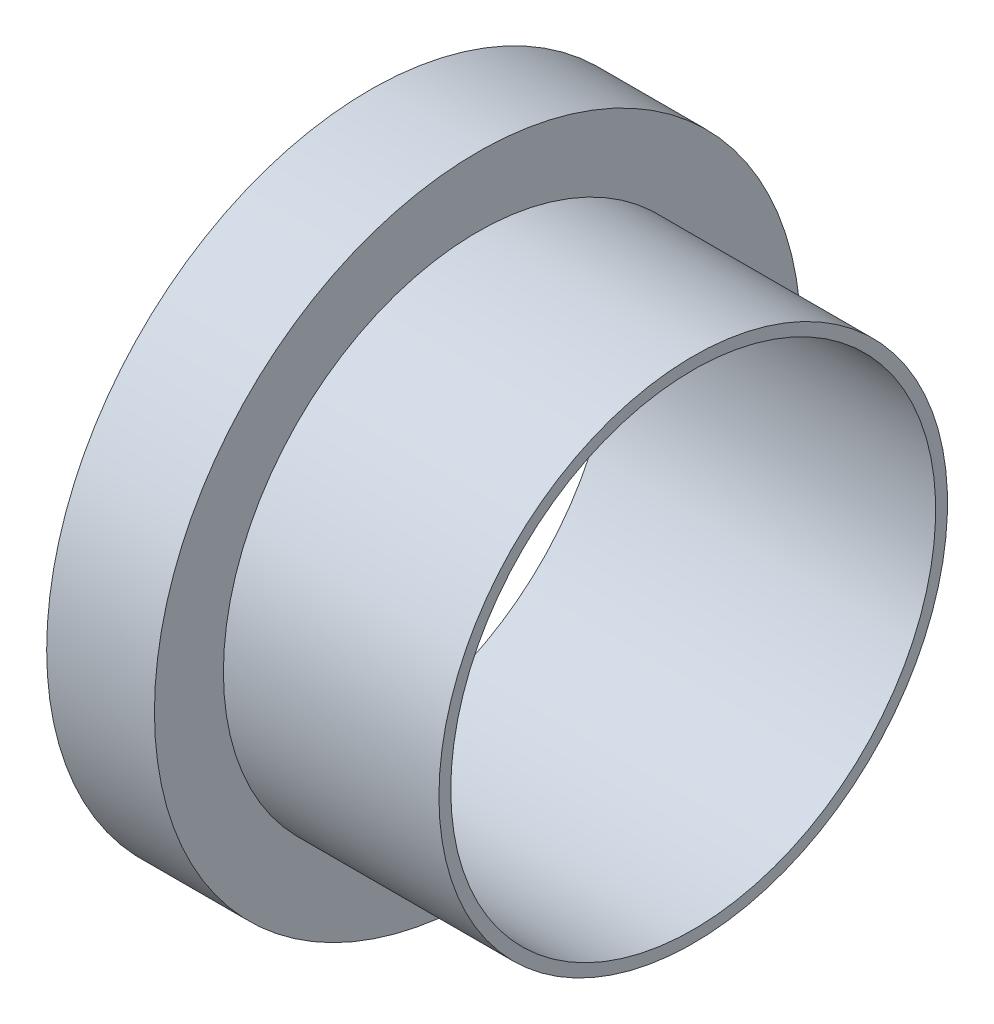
from build123d import *


with BuildPart() as part:
    # Sketch1 → Revolve1 (revolve)
    with BuildSketch(Plane.XY, mode=Mode.PRIVATE) as revolve1_sk:
        Polygon((0, 14.2875), (19.05, 14.2875), (19.05, 14.986), (6.35, 14.986), (6.35, 19.05), (0, 19.05), align=None)
    revolve(revolve1_sk.sketch.rotate(Axis((0, 0, 0), (1, 0, 0)), 90), axis=Axis((0, 0, 0), (1, 0, 0)))


solid = part.part
